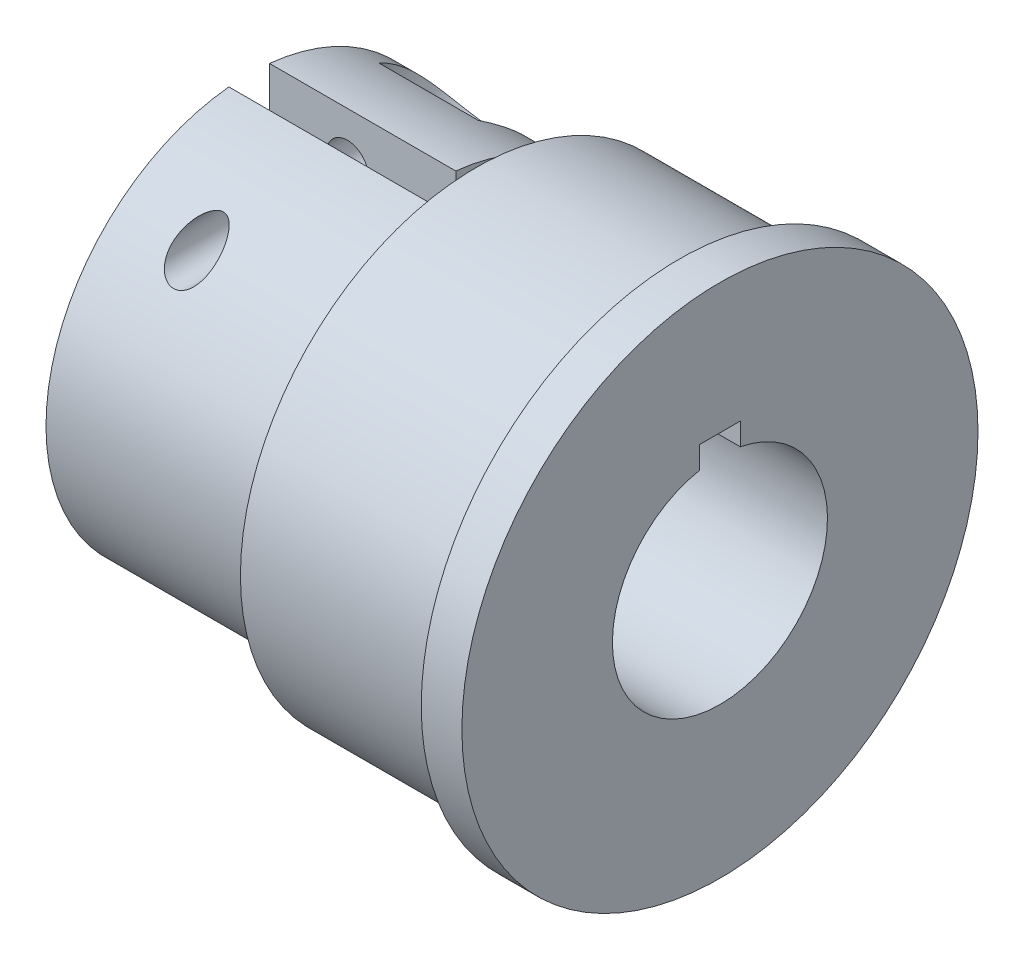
from build123d import *

# Parameters (mm, degrees)
SKETCH1_W               = 3
SKETCH1_H               = 1.651
SKETCH2_W               = 3
SKETCH2_H               = 3
CUT_EXTRUDE1_DEPTH      = 33.400694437
BOSS_EXTRUDE2_DEPTH     = 30
SKETCH7_W               = 3
SKETCH7_H               = 33.93511961
CUT_EXTRUDE3_DEPTH      = 30
CUT_EXTRUDE4_DEPTH      = 42.051248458
CUT_EXTRUDE4_DEPTH_BACK = 42.051248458
SKETCH8_R               = 1.533462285
CUT_EXTRUDE5_DEPTH      = 47.863685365
CUT_EXTRUDE5_DEPTH_BACK = 4
SKETCH9_R               = 4
CUT_EXTRUDE6_DEPTH      = 41.321272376
CUT_EXTRUDE6_DEPTH_BACK = 41.321272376
SKETCH10_W              = 15.409706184
SKETCH10_H              = 32.735213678


with BuildPart() as part:
    # Sketch1 → Revolve1 (revolve)
    with BuildSketch(Plane.XY, mode=Mode.PRIVATE) as revolve1_sk:
        Polygon((15, 17.399), (0, 17.399), (0, 7.9375), (18, 7.9375), (18, 17.399), align=None)
        with Locations((16.5, 18.2245)):
            Rectangle(SKETCH1_W, SKETCH1_H)
    revolve(revolve1_sk.sketch.rotate(Axis((0, 0, 0), (1, 0, 0)), 90), axis=Axis((0, 0, 0), (1, 0, 0)))

    # Sketch2 → Cut-Extrude1 (cut, through all)
    with BuildSketch(Plane(origin=(18, 0, 0), x_dir=(0, 0, -1), z_dir=(1, 0, 0))):
        with Locations((0, 7.9375)):
            Rectangle(SKETCH2_W, SKETCH2_H)
    extrude(amount=-CUT_EXTRUDE1_DEPTH, mode=Mode.SUBTRACT)

    # Sketch6 → Boss-Extrude2 (add)
    with BuildSketch(Plane.ZY):
        with BuildLine():
            Line((-1.5, 9.4375), (-1.5, 14.924811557))
            ThreePointArc((-1.5, 14.924811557), (-10.062305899, -11.124297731), (15, 0))
            ThreePointArc((15, 0), (11.124297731, 10.062305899), (1.5, 14.924811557))
            Line((1.5, 14.924811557), (1.5, 9.4375))
            Line((1.5, 9.4375), (1.5, 7.794479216))
            ThreePointArc((1.5, 7.794479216), (6.120055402, 5.054584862), (7.9375, 0))
            ThreePointArc((7.9375, 0), (-5.054584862, -6.120055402), (-1.5, 7.794479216))
            Line((-1.5, 7.794479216), (-1.5, 9.4375))
        make_face()
    extrude(amount=BOSS_EXTRUDE2_DEPTH)

    # Sketch7 → Cut-Extrude3 (cut)
    with BuildSketch(Plane.XY):
        with Locations((-1.5, 0)):
            Rectangle(SKETCH7_W, SKETCH7_H)
    extrude(amount=-CUT_EXTRUDE3_DEPTH, mode=Mode.SUBTRACT)

    # Sketch8 → Cut-Extrude4 (cut, two sides: drawn at the far end of the back side and taken through both)
    with BuildSketch(Plane.XY.offset(-1.5).offset(-CUT_EXTRUDE4_DEPTH_BACK)):
        with Locations((-22, 11.359645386)):
            Circle(SKETCH8_R)
        with Locations((-11, 11.359645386)):
            Circle(SKETCH8_R)
    extrude(amount=CUT_EXTRUDE4_DEPTH + CUT_EXTRUDE4_DEPTH_BACK, mode=Mode.SUBTRACT)

    # Sketch9 → Cut-Extrude5 (cut, two sides: drawn at the far end of the back side and taken through both)
    with BuildSketch(Plane(origin=(0, 0, -11.5), x_dir=(-1, 0, 0), z_dir=(0, 0, -1)).offset(-CUT_EXTRUDE5_DEPTH_BACK)):
        with Locations((11, 11.359645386)):
            Circle(SKETCH9_R)
        with Locations((22, 11.359645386)):
            Circle(SKETCH9_R)
    extrude(amount=CUT_EXTRUDE5_DEPTH + CUT_EXTRUDE5_DEPTH_BACK, mode=Mode.SUBTRACT)

    # Sketch10 → Cut-Extrude6 (cut, two sides: drawn at the far end of the back side and taken through both)
    with BuildSketch(Plane.XY.offset(-CUT_EXTRUDE6_DEPTH_BACK)):
        with Locations((-24.457139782, -0.91129191)):
            Rectangle(SKETCH10_W, SKETCH10_H)
    extrude(amount=CUT_EXTRUDE6_DEPTH + CUT_EXTRUDE6_DEPTH_BACK, mode=Mode.SUBTRACT)


solid = part.part
